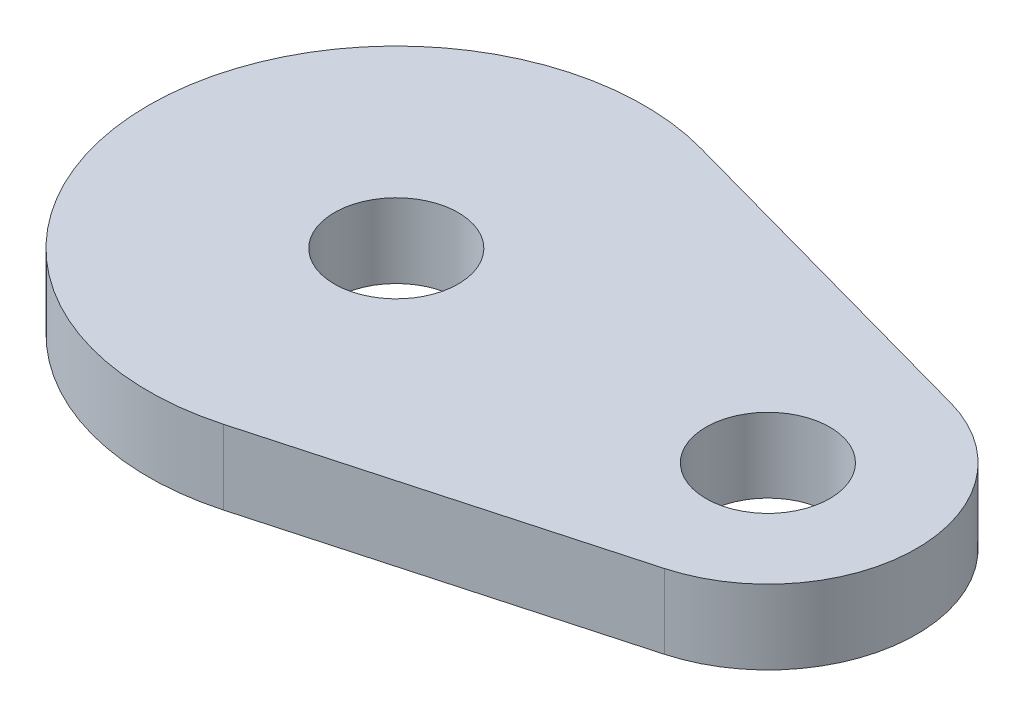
from build123d import *

# Parameters (mm, degrees)
SKETCH1_R      = 2.5
EXTRUDE1_DEPTH = 3


with BuildPart() as part:
    # Sketch1 → Extrude1 (new body)
    with BuildSketch(Plane(origin=(0, 0, 0), x_dir=(1, 0, 0), z_dir=(0, 1, 0))):
        with BuildLine():
            Line((2.666666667, 9.637888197), (16.6, 5.782732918))
            ThreePointArc((16.6, 5.782732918), (21, 0), (16.6, -5.782732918))
            Line((16.6, -5.782732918), (2.666666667, -9.637888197))
            ThreePointArc((2.666666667, -9.637888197), (-10, 0), (2.666666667, 9.637888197))
        make_face()
        with Locations(Location((15, 0, 0), (0, 0, 270))):
            Circle(SKETCH1_R, mode=Mode.SUBTRACT)
        with Locations(Location((0, 0, 0), (0, 0, 270))):
            Circle(SKETCH1_R, mode=Mode.SUBTRACT)
    extrude(amount=EXTRUDE1_DEPTH)


solid = part.part
